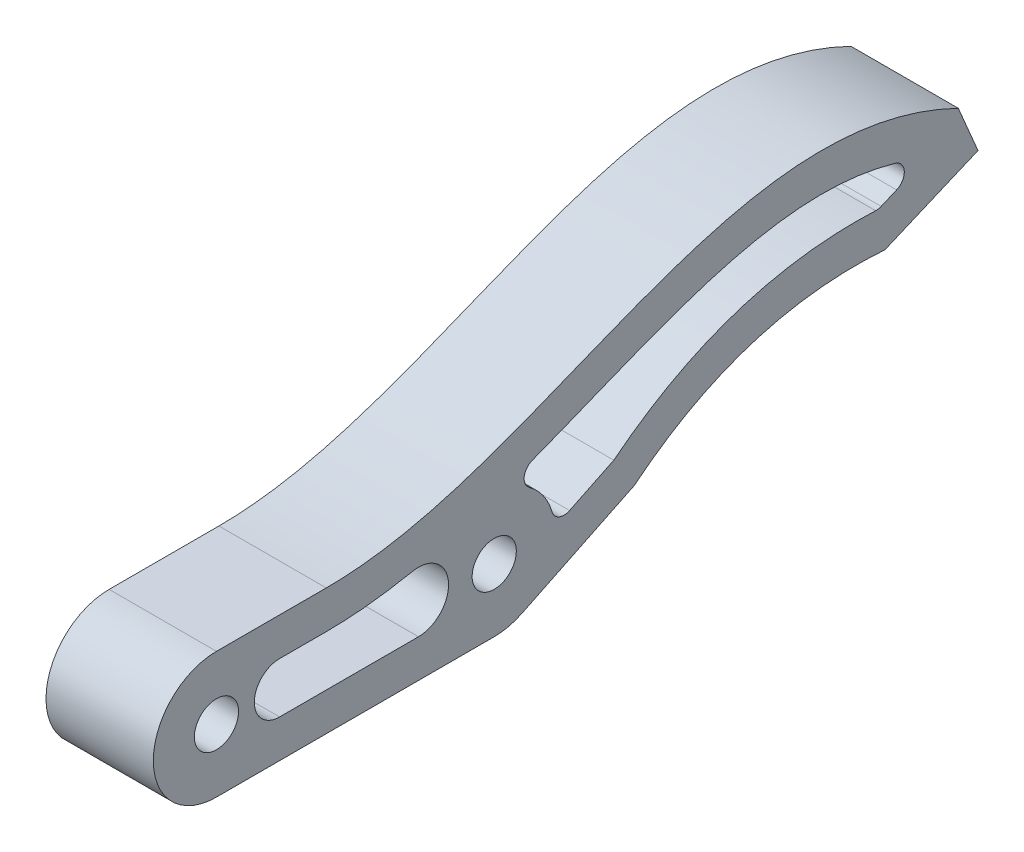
ISO-10303-21;
HEADER;
FILE_DESCRIPTION(('STEP AP214'),'2;1');
FILE_NAME('part.step','',(''),(''),'','','');
FILE_SCHEMA(('AUTOMOTIVE_DESIGN { 1 0 10303 214 1 1 1 1 }'));
ENDSEC;
DATA;
#1=APPLICATION_CONTEXT('core data for automotive mechanical design processes');
#2=APPLICATION_PROTOCOL_DEFINITION('international standard','automotive_design',2000,#1);
#3=PRODUCT_CONTEXT('',#1,'mechanical');
#4=PRODUCT('Part','Part','',(#3));
#5=PRODUCT_RELATED_PRODUCT_CATEGORY('part','',(#4));
#6=PRODUCT_DEFINITION_FORMATION('','',#4);
#7=PRODUCT_DEFINITION_CONTEXT('part definition',#1,'design');
#8=PRODUCT_DEFINITION('design','',#6,#7);
#9=PRODUCT_DEFINITION_SHAPE('','',#8);
#10=(LENGTH_UNIT() NAMED_UNIT(*) SI_UNIT(.MILLI.,.METRE.));
#11=(NAMED_UNIT(*) PLANE_ANGLE_UNIT() SI_UNIT($,.RADIAN.));
#12=(NAMED_UNIT(*) SI_UNIT($,.STERADIAN.) SOLID_ANGLE_UNIT());
#13=UNCERTAINTY_MEASURE_WITH_UNIT(LENGTH_MEASURE(1.E-05),#10,'distance_accuracy_value','');
#14=(GEOMETRIC_REPRESENTATION_CONTEXT(3) GLOBAL_UNCERTAINTY_ASSIGNED_CONTEXT((#13)) GLOBAL_UNIT_ASSIGNED_CONTEXT((#10,
#11,#12)) REPRESENTATION_CONTEXT('',''));
#15=CARTESIAN_POINT('',(0.,0.,0.));
#16=DIRECTION('',(0.,0.,1.));
#17=DIRECTION('',(1.,0.,0.));
#18=AXIS2_PLACEMENT_3D('',#15,#16,#17);
#19=CARTESIAN_POINT('',(8.5,5.,-27.));
#20=DIRECTION('',(-1.,0.,0.));
#21=DIRECTION('',(0.,0.,1.));
#22=AXIS2_PLACEMENT_3D('',#19,#20,#21);
#23=CYLINDRICAL_SURFACE('',#22,5.);
#24=DIRECTION('',(1.,0.,0.));
#25=VECTOR('',#24,1.);
#26=CARTESIAN_POINT('',(0.,0.502127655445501,-29.1838370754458));
#27=LINE('',#26,#25);
#28=CARTESIAN_POINT('',(0.,0.502127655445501,-29.1838370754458));
#29=VERTEX_POINT('',#28);
#30=CARTESIAN_POINT('',(8.5,0.502127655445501,-29.1838370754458));
#31=VERTEX_POINT('',#30);
#32=EDGE_CURVE('E597',#29,#31,#27,.T.);
#33=ORIENTED_EDGE('',*,*,#32,.T.);
#34=CARTESIAN_POINT('',(8.5,5.,-27.));
#35=DIRECTION('',(1.,0.,0.));
#36=DIRECTION('',(0.,0.,-1.));
#37=AXIS2_PLACEMENT_3D('',#34,#35,#36);
#38=CIRCLE('',#37,5.);
#39=CARTESIAN_POINT('',(8.5,0.,-27.));
#40=VERTEX_POINT('',#39);
#41=EDGE_CURVE('E583',#40,#31,#38,.T.);
#42=ORIENTED_EDGE('',*,*,#41,.F.);
#43=DIRECTION('',(-1.,0.,0.));
#44=VECTOR('',#43,1.);
#45=CARTESIAN_POINT('',(8.5,0.,-27.));
#46=LINE('',#45,#44);
#47=CARTESIAN_POINT('',(0.,0.,-27.));
#48=VERTEX_POINT('',#47);
#49=EDGE_CURVE('E554',#40,#48,#46,.T.);
#50=ORIENTED_EDGE('',*,*,#49,.T.);
#51=CARTESIAN_POINT('',(0.,5.,-27.));
#52=DIRECTION('',(1.,0.,0.));
#53=DIRECTION('',(0.,0.,-1.));
#54=AXIS2_PLACEMENT_3D('',#51,#52,#53);
#55=CIRCLE('',#54,5.);
#56=EDGE_CURVE('E567',#48,#29,#55,.T.);
#57=ORIENTED_EDGE('',*,*,#56,.T.);
#58=EDGE_LOOP('',(#33,#42,#50,#57));
#59=FACE_BOUND('',#58,.T.);
#60=ADVANCED_FACE('F45',(#59),#23,.T.);
#61=CARTESIAN_POINT('',(8.5,10.,0.));
#62=DIRECTION('',(0.,1.,0.));
#63=DIRECTION('',(0.,0.,1.));
#64=AXIS2_PLACEMENT_3D('',#61,#62,#63);
#65=PLANE('',#64);
#66=DIRECTION('',(1.,0.,0.));
#67=VECTOR('',#66,1.);
#68=CARTESIAN_POINT('',(0.,10.,-13.6949747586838));
#69=LINE('',#68,#67);
#70=CARTESIAN_POINT('',(0.,10.,-13.6949747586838));
#71=VERTEX_POINT('',#70);
#72=CARTESIAN_POINT('',(8.5,10.,-13.6949747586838));
#73=VERTEX_POINT('',#72);
#74=EDGE_CURVE('E594',#71,#73,#69,.T.);
#75=ORIENTED_EDGE('',*,*,#74,.F.);
#76=DIRECTION('',(0.,0.,-1.));
#77=VECTOR('',#76,1.);
#78=CARTESIAN_POINT('',(0.,10.,0.));
#79=LINE('',#78,#77);
#80=CARTESIAN_POINT('',(0.,10.,-5.));
#81=VERTEX_POINT('',#80);
#82=EDGE_CURVE('E574',#81,#71,#79,.T.);
#83=ORIENTED_EDGE('',*,*,#82,.F.);
#84=DIRECTION('',(-1.,0.,0.));
#85=VECTOR('',#84,1.);
#86=CARTESIAN_POINT('',(8.5,10.,-5.));
#87=LINE('',#86,#85);
#88=CARTESIAN_POINT('',(8.5,10.,-5.));
#89=VERTEX_POINT('',#88);
#90=EDGE_CURVE('E547',#89,#81,#87,.T.);
#91=ORIENTED_EDGE('',*,*,#90,.F.);
#92=DIRECTION('',(0.,0.,-1.));
#93=VECTOR('',#92,1.);
#94=CARTESIAN_POINT('',(8.5,10.,0.));
#95=LINE('',#94,#93);
#96=EDGE_CURVE('E563',#89,#73,#95,.T.);
#97=ORIENTED_EDGE('',*,*,#96,.T.);
#98=EDGE_LOOP('',(#75,#83,#91,#97));
#99=FACE_BOUND('',#98,.T.);
#100=ADVANCED_FACE('F645',(#99),#65,.T.);
#101=CARTESIAN_POINT('',(8.5,5.,-5.));
#102=DIRECTION('',(-1.,0.,0.));
#103=DIRECTION('',(0.,0.,1.));
#104=AXIS2_PLACEMENT_3D('',#101,#102,#103);
#105=CYLINDRICAL_SURFACE('',#104,5.);
#106=CARTESIAN_POINT('',(0.,5.,-5.));
#107=DIRECTION('',(1.,0.,0.));
#108=DIRECTION('',(0.,0.,-1.));
#109=AXIS2_PLACEMENT_3D('',#106,#107,#108);
#110=CIRCLE('',#109,5.);
#111=CARTESIAN_POINT('',(0.,0.,-5.));
#112=VERTEX_POINT('',#111);
#113=EDGE_CURVE('E572',#81,#112,#110,.T.);
#114=ORIENTED_EDGE('',*,*,#113,.T.);
#115=DIRECTION('',(-1.,0.,0.));
#116=VECTOR('',#115,1.);
#117=CARTESIAN_POINT('',(8.5,0.,-5.));
#118=LINE('',#117,#116);
#119=CARTESIAN_POINT('',(8.5,0.,-5.));
#120=VERTEX_POINT('',#119);
#121=EDGE_CURVE('E549',#120,#112,#118,.T.);
#122=ORIENTED_EDGE('',*,*,#121,.F.);
#123=CARTESIAN_POINT('',(8.5,5.,-5.));
#124=DIRECTION('',(1.,0.,0.));
#125=DIRECTION('',(0.,0.,-1.));
#126=AXIS2_PLACEMENT_3D('',#123,#124,#125);
#127=CIRCLE('',#126,5.);
#128=EDGE_CURVE('E588',#89,#120,#127,.T.);
#129=ORIENTED_EDGE('',*,*,#128,.F.);
#130=ORIENTED_EDGE('',*,*,#90,.T.);
#131=EDGE_LOOP('',(#114,#122,#129,#130));
#132=FACE_BOUND('',#131,.T.);
#133=ADVANCED_FACE('F651',(#132),#105,.T.);
#134=CARTESIAN_POINT('',(8.5,0.,0.));
#135=DIRECTION('',(0.,1.,0.));
#136=DIRECTION('',(0.,0.,1.));
#137=AXIS2_PLACEMENT_3D('',#134,#135,#136);
#138=PLANE('',#137);
#139=DIRECTION('',(0.,0.,-1.));
#140=VECTOR('',#139,1.);
#141=CARTESIAN_POINT('',(0.,0.,0.));
#142=LINE('',#141,#140);
#143=EDGE_CURVE('E570',#112,#48,#142,.T.);
#144=ORIENTED_EDGE('',*,*,#143,.T.);
#145=ORIENTED_EDGE('',*,*,#49,.F.);
#146=DIRECTION('',(0.,0.,-1.));
#147=VECTOR('',#146,1.);
#148=CARTESIAN_POINT('',(8.5,0.,0.));
#149=LINE('',#148,#147);
#150=EDGE_CURVE('E586',#120,#40,#149,.T.);
#151=ORIENTED_EDGE('',*,*,#150,.F.);
#152=ORIENTED_EDGE('',*,*,#121,.T.);
#153=EDGE_LOOP('',(#144,#145,#151,#152));
#154=FACE_BOUND('',#153,.T.);
#155=ADVANCED_FACE('F657',(#154),#138,.F.);
#156=CARTESIAN_POINT('',(8.5,5.,-5.));
#157=DIRECTION('',(-1.,0.,0.));
#158=DIRECTION('',(0.,0.,1.));
#159=AXIS2_PLACEMENT_3D('',#156,#157,#158);
#160=CYLINDRICAL_SURFACE('',#159,1.75);
#161=CARTESIAN_POINT('',(8.5,5.,-5.));
#162=DIRECTION('',(1.,0.,0.));
#163=DIRECTION('',(0.,0.,-1.));
#164=AXIS2_PLACEMENT_3D('',#161,#162,#163);
#165=CIRCLE('',#164,1.75);
#166=CARTESIAN_POINT('',(8.5,5.,-6.75));
#167=VERTEX_POINT('',#166);
#168=EDGE_CURVE('E580',#167,#167,#165,.T.);
#169=ORIENTED_EDGE('',*,*,#168,.T.);
#170=EDGE_LOOP('',(#169));
#171=FACE_BOUND('',#170,.T.);
#172=CARTESIAN_POINT('',(0.,5.,-5.));
#173=DIRECTION('',(1.,0.,0.));
#174=DIRECTION('',(0.,0.,-1.));
#175=AXIS2_PLACEMENT_3D('',#172,#173,#174);
#176=CIRCLE('',#175,1.75);
#177=CARTESIAN_POINT('',(0.,5.,-6.75));
#178=VERTEX_POINT('',#177);
#179=EDGE_CURVE('E564',#178,#178,#176,.T.);
#180=ORIENTED_EDGE('',*,*,#179,.F.);
#181=EDGE_LOOP('',(#180));
#182=FACE_BOUND('',#181,.T.);
#183=ADVANCED_FACE('F656',(#171,#182),#160,.F.);
#184=CARTESIAN_POINT('',(8.5,5.,-27.));
#185=DIRECTION('',(-1.,0.,0.));
#186=DIRECTION('',(0.,0.,1.));
#187=AXIS2_PLACEMENT_3D('',#184,#185,#186);
#188=CYLINDRICAL_SURFACE('',#187,1.75);
#189=CARTESIAN_POINT('',(8.5,5.,-27.));
#190=DIRECTION('',(1.,0.,0.));
#191=DIRECTION('',(0.,0.,-1.));
#192=AXIS2_PLACEMENT_3D('',#189,#190,#191);
#193=CIRCLE('',#192,1.75);
#194=CARTESIAN_POINT('',(8.5,5.,-28.75));
#195=VERTEX_POINT('',#194);
#196=EDGE_CURVE('E559',#195,#195,#193,.T.);
#197=ORIENTED_EDGE('',*,*,#196,.T.);
#198=EDGE_LOOP('',(#197));
#199=FACE_BOUND('',#198,.T.);
#200=CARTESIAN_POINT('',(0.,5.,-27.));
#201=DIRECTION('',(1.,0.,0.));
#202=DIRECTION('',(0.,0.,-1.));
#203=AXIS2_PLACEMENT_3D('',#200,#201,#202);
#204=CIRCLE('',#203,1.75);
#205=CARTESIAN_POINT('',(0.,5.,-28.75));
#206=VERTEX_POINT('',#205);
#207=EDGE_CURVE('E560',#206,#206,#204,.T.);
#208=ORIENTED_EDGE('',*,*,#207,.F.);
#209=EDGE_LOOP('',(#208));
#210=FACE_BOUND('',#209,.T.);
#211=ADVANCED_FACE('F366',(#199,#210),#188,.F.);
#212=CARTESIAN_POINT('',(8.5,0.,0.));
#213=DIRECTION('',(1.,0.,0.));
#214=DIRECTION('',(0.,0.,-1.));
#215=AXIS2_PLACEMENT_3D('',#212,#213,#214);
#216=PLANE('',#215);
#217=CARTESIAN_POINT('',(8.5,5.,-10.));
#218=DIRECTION('',(-1.,0.,0.));
#219=DIRECTION('',(0.,0.,1.));
#220=AXIS2_PLACEMENT_3D('',#217,#218,#219);
#221=CIRCLE('',#220,2.);
#222=CARTESIAN_POINT('',(8.5,3.,-10.));
#223=VERTEX_POINT('',#222);
#224=CARTESIAN_POINT('',(8.5,7.,-10.));
#225=VERTEX_POINT('',#224);
#226=EDGE_CURVE('E205',#223,#225,#221,.T.);
#227=ORIENTED_EDGE('',*,*,#226,.T.);
#228=DIRECTION('',(0.,0.,-1.));
#229=VECTOR('',#228,1.);
#230=CARTESIAN_POINT('',(8.5,7.,-13.6949747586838));
#231=LINE('',#230,#229);
#232=CARTESIAN_POINT('',(8.5,7.,-13.6949747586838));
#233=VERTEX_POINT('',#232);
#234=EDGE_CURVE('E217',#225,#233,#231,.T.);
#235=ORIENTED_EDGE('',*,*,#234,.T.);
#236=CARTESIAN_POINT('',(8.5,7.71980303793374,-20.5267376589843));
#237=CARTESIAN_POINT('',(8.5,7.27218222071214,-18.3171382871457));
#238=CARTESIAN_POINT('',(8.5,7.,-16.0394109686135));
#239=CARTESIAN_POINT('',(8.5,7.,-13.6949747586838));
#240=B_SPLINE_CURVE_WITH_KNOTS('',3,(#236,#237,#238,#239),.UNSPECIFIED.,.F.,.F.,(4,4),(0.,
0.121649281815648),.UNSPECIFIED.);
#241=CARTESIAN_POINT('',(8.5,7.71980303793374,-20.5267376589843));
#242=VERTEX_POINT('',#241);
#243=EDGE_CURVE('E221',#233,#242,#240,.F.);
#244=ORIENTED_EDGE('',*,*,#243,.T.);
#245=CARTESIAN_POINT('',(8.5,5.38362891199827,-21.));
#246=DIRECTION('',(-1.,0.,0.));
#247=DIRECTION('',(0.,0.,1.));
#248=AXIS2_PLACEMENT_3D('',#245,#246,#247);
#249=CIRCLE('',#248,2.38362891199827);
#250=CARTESIAN_POINT('',(8.5,3.,-21.));
#251=VERTEX_POINT('',#250);
#252=EDGE_CURVE('E480',#242,#251,#249,.T.);
#253=ORIENTED_EDGE('',*,*,#252,.T.);
#254=DIRECTION('',(0.,0.,1.));
#255=VECTOR('',#254,1.);
#256=CARTESIAN_POINT('',(8.5,3.,-10.));
#257=LINE('',#256,#255);
#258=EDGE_CURVE('E213',#251,#223,#257,.T.);
#259=ORIENTED_EDGE('',*,*,#258,.T.);
#260=EDGE_LOOP('',(#227,#235,#244,#253,#259));
#261=FACE_BOUND('',#260,.T.);
#262=CARTESIAN_POINT('',(8.5,5.,-27.));
#263=DIRECTION('',(1.,0.,0.));
#264=DIRECTION('',(0.,0.,1.));
#265=AXIS2_PLACEMENT_3D('',#262,#263,#264);
#266=CIRCLE('',#265,4.75);
#267=CARTESIAN_POINT('',(8.5,6.29990299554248,-31.568670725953));
#268=VERTEX_POINT('',#267);
#269=CARTESIAN_POINT('',(8.5,8.85013348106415,-29.7819008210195));
#270=VERTEX_POINT('',#269);
#271=EDGE_CURVE('E294',#268,#270,#266,.T.);
#272=ORIENTED_EDGE('',*,*,#271,.T.);
#273=CARTESIAN_POINT('',(8.5,9.66068789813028,-30.3675641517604));
#274=DIRECTION('',(1.,0.,0.));
#275=DIRECTION('',(0.,0.,-1.));
#276=AXIS2_PLACEMENT_3D('',#273,#274,#275);
#277=CIRCLE('',#276,1.);
#278=CARTESIAN_POINT('',(8.5,10.5960936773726,-30.012977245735));
#279=VERTEX_POINT('',#278);
#280=EDGE_CURVE('E510',#270,#279,#277,.F.);
#281=ORIENTED_EDGE('',*,*,#280,.T.);
#282=CARTESIAN_POINT('',(8.5,16.5979910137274,-58.7502320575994));
#283=CARTESIAN_POINT('',(8.5,16.796520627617,-58.0528071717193));
#284=CARTESIAN_POINT('',(8.5,16.9539827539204,-57.3619943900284));
#285=CARTESIAN_POINT('',(8.5,17.4059040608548,-54.801858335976));
#286=CARTESIAN_POINT('',(8.5,17.4661629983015,-52.9551397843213));
#287=CARTESIAN_POINT('',(8.5,17.1706448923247,-49.2263439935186));
#288=CARTESIAN_POINT('',(8.5,16.8124814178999,-47.3449992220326));
#289=CARTESIAN_POINT('',(8.5,15.7923179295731,-43.5217260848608));
#290=CARTESIAN_POINT('',(8.5,15.1303137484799,-41.5812954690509));
#291=CARTESIAN_POINT('',(8.5,13.6451743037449,-37.6352435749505));
#292=CARTESIAN_POINT('',(8.5,12.8223926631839,-35.6300299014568));
#293=CARTESIAN_POINT('',(8.5,11.5261343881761,-32.4083186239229));
#294=CARTESIAN_POINT('',(8.5,11.05278823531,-31.2187538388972));
#295=CARTESIAN_POINT('',(8.5,10.5957590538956,-30.0131040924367));
#296=B_SPLINE_CURVE_WITH_KNOTS('',3,(#282,#283,#284,#285,#286,#287,#288,#289,#290,#291,#292,
#293,#294,#295),.UNSPECIFIED.,.F.,.F.,(4,2,2,2,2,2,4),(0.303121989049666,0.348941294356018,
0.473941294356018,0.598941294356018,0.723941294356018,0.848941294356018,0.920819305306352),.UNSPECIFIED.);
#297=CARTESIAN_POINT('',(8.5,16.5978363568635,-58.7501880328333));
#298=VERTEX_POINT('',#297);
#299=EDGE_CURVE('E289',#279,#298,#296,.F.);
#300=ORIENTED_EDGE('',*,*,#299,.T.);
#301=CARTESIAN_POINT('',(8.5,15.6361998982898,-58.476447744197));
#302=DIRECTION('',(1.,0.,0.));
#303=DIRECTION('',(0.,0.,-1.));
#304=AXIS2_PLACEMENT_3D('',#301,#302,#303);
#305=CIRCLE('',#304,1.);
#306=CARTESIAN_POINT('',(8.5,14.7154737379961,-58.8666570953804));
#307=VERTEX_POINT('',#306);
#308=EDGE_CURVE('E11',#298,#307,#305,.F.);
#309=ORIENTED_EDGE('',*,*,#308,.T.);
#310=DIRECTION('',(0.,-0.39020935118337,0.920726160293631));
#311=VECTOR('',#310,1.);
#312=CARTESIAN_POINT('',(8.5,14.1066831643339,-57.4301733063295));
#313=LINE('',#312,#311);
#314=CARTESIAN_POINT('',(8.5,14.1960940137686,-57.6411444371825));
#315=VERTEX_POINT('',#314);
#316=EDGE_CURVE('E499',#307,#315,#313,.T.);
#317=ORIENTED_EDGE('',*,*,#316,.T.);
#318=CARTESIAN_POINT('',(8.5,15.1168201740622,-57.2509350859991));
#319=DIRECTION('',(1.,0.,0.));
#320=DIRECTION('',(0.,0.,-1.));
#321=AXIS2_PLACEMENT_3D('',#318,#319,#320);
#322=CIRCLE('',#321,1.);
#323=CARTESIAN_POINT('',(8.5,14.1178972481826,-57.2045618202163));
#324=VERTEX_POINT('',#323);
#325=EDGE_CURVE('E518',#315,#324,#322,.F.);
#326=ORIENTED_EDGE('',*,*,#325,.T.);
#327=CARTESIAN_POINT('',(8.5,7.37494733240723,-36.4705828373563));
#328=CARTESIAN_POINT('',(8.5,8.6233127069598,-38.0402338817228));
#329=CARTESIAN_POINT('',(8.5,9.70763847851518,-39.6774903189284));
#330=CARTESIAN_POINT('',(8.5,11.5318379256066,-43.0806957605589));
#331=CARTESIAN_POINT('',(8.5,12.271381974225,-44.8465467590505));
#332=CARTESIAN_POINT('',(8.5,13.393385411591,-48.4888330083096));
#333=CARTESIAN_POINT('',(8.5,13.7757268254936,-50.3648820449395));
#334=CARTESIAN_POINT('',(8.5,14.15011014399,-53.8954716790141));
#335=CARTESIAN_POINT('',(8.5,14.1953220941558,-55.5367321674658));
#336=CARTESIAN_POINT('',(8.5,14.1178959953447,-57.2045617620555));
#337=B_SPLINE_CURVE_WITH_KNOTS('',3,(#327,#328,#329,#330,#331,#332,#333,#334,#335,#336),
.UNSPECIFIED.,.F.,.F.,(4,2,2,2,4),(0.0403332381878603,0.29033323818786,0.54033323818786,
0.79033323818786,1.),.UNSPECIFIED.);
#338=CARTESIAN_POINT('',(8.5,7.37494733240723,-36.4705828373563));
#339=VERTEX_POINT('',#338);
#340=EDGE_CURVE('E391',#324,#339,#337,.F.);
#341=ORIENTED_EDGE('',*,*,#340,.T.);
#342=DIRECTION('',(0.,-0.436767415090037,0.899574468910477));
#343=VECTOR('',#342,1.);
#344=CARTESIAN_POINT('',(8.5,5.08262939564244,-31.7492812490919));
#345=LINE('',#344,#343);
#346=CARTESIAN_POINT('',(8.5,5.67399231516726,-32.9672635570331));
#347=VERTEX_POINT('',#346);
#348=EDGE_CURVE('E297',#339,#347,#345,.T.);
#349=ORIENTED_EDGE('',*,*,#348,.T.);
#350=CARTESIAN_POINT('',(8.5,6.57356678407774,-32.5304961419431));
#351=DIRECTION('',(1.,0.,0.));
#352=DIRECTION('',(0.,0.,-1.));
#353=AXIS2_PLACEMENT_3D('',#350,#351,#352);
#354=CIRCLE('',#353,1.);
#355=EDGE_CURVE('E506',#347,#268,#354,.F.);
#356=ORIENTED_EDGE('',*,*,#355,.T.);
#357=EDGE_LOOP('',(#272,#281,#300,#309,#317,#326,#341,#349,#356));
#358=FACE_BOUND('',#357,.T.);
#359=ORIENTED_EDGE('',*,*,#96,.F.);
#360=ORIENTED_EDGE('',*,*,#128,.T.);
#361=ORIENTED_EDGE('',*,*,#150,.T.);
#362=ORIENTED_EDGE('',*,*,#41,.T.);
#363=DIRECTION('',(0.,0.436767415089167,-0.8995744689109));
#364=VECTOR('',#363,1.);
#365=CARTESIAN_POINT('',(8.5,-11.0601312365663,-5.36998891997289));
#366=LINE('',#365,#364);
#367=CARTESIAN_POINT('',(8.5,4.82408407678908,-38.0854206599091));
#368=VERTEX_POINT('',#367);
#369=EDGE_CURVE('E612',#31,#368,#366,.T.);
#370=ORIENTED_EDGE('',*,*,#369,.T.);
#371=CARTESIAN_POINT('',(8.5,4.82408407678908,-38.0854206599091));
#372=CARTESIAN_POINT('',(8.5,11.8952224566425,-46.7975095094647));
#373=CARTESIAN_POINT('',(8.5,11.0678436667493,-57.9480004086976));
#374=B_SPLINE_CURVE_WITH_KNOTS('',2,(#371,#372,#373),.UNSPECIFIED.,.F.,.F.,(3,3),(0.,1.),.UNSPECIFIED.);
#375=CARTESIAN_POINT('',(8.5,11.0678436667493,-57.9480004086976));
#376=VERTEX_POINT('',#375);
#377=EDGE_CURVE('E607',#368,#376,#374,.T.);
#378=ORIENTED_EDGE('',*,*,#377,.T.);
#379=DIRECTION('',(0.,0.39020935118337,-0.920726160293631));
#380=VECTOR('',#379,1.);
#381=CARTESIAN_POINT('',(8.5,-11.4367064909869,-4.84694582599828));
#382=LINE('',#381,#380);
#383=CARTESIAN_POINT('',(8.5,14.1895184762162,-65.3138096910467));
#384=VERTEX_POINT('',#383);
#385=EDGE_CURVE('E341',#376,#384,#382,.T.);
#386=ORIENTED_EDGE('',*,*,#385,.T.);
#387=DIRECTION('',(0.,0.920726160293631,0.39020935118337));
#388=VECTOR('',#387,1.);
#389=CARTESIAN_POINT('',(8.5,25.6262249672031,-60.4668638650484));
#390=LINE('',#389,#388);
#391=CARTESIAN_POINT('',(8.5,17.8724231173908,-63.7529722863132));
#392=VERTEX_POINT('',#391);
#393=EDGE_CURVE('E487',#384,#392,#390,.T.);
#394=ORIENTED_EDGE('',*,*,#393,.T.);
#395=CARTESIAN_POINT('',(8.5,17.8724231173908,-63.7529722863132));
#396=CARTESIAN_POINT('',(8.5,26.563787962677,-45.9288826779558));
#397=CARTESIAN_POINT('',(8.5,10.,-31.059268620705));
#398=CARTESIAN_POINT('',(8.5,10.,-13.6949747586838));
#399=B_SPLINE_CURVE_WITH_KNOTS('',3,(#395,#396,#397,#398),.UNSPECIFIED.,.F.,.F.,(4,4),(0.,1.),.UNSPECIFIED.);
#400=EDGE_CURVE('E490',#392,#73,#399,.T.);
#401=ORIENTED_EDGE('',*,*,#400,.T.);
#402=EDGE_LOOP('',(#359,#360,#361,#362,#370,#378,#386,#394,#401));
#403=FACE_BOUND('',#402,.T.);
#404=ORIENTED_EDGE('',*,*,#168,.F.);
#405=EDGE_LOOP('',(#404));
#406=FACE_BOUND('',#405,.T.);
#407=ORIENTED_EDGE('',*,*,#196,.F.);
#408=EDGE_LOOP('',(#407));
#409=FACE_BOUND('',#408,.T.);
#410=ADVANCED_FACE('F223',(#261,#358,#403,#406,#409),#216,.T.);
#411=CARTESIAN_POINT('',(0.,0.,0.));
#412=DIRECTION('',(1.,0.,0.));
#413=DIRECTION('',(0.,0.,-1.));
#414=AXIS2_PLACEMENT_3D('',#411,#412,#413);
#415=PLANE('',#414);
#416=DIRECTION('',(0.,0.,-1.));
#417=VECTOR('',#416,1.);
#418=CARTESIAN_POINT('',(0.,7.,-13.6949747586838));
#419=LINE('',#418,#417);
#420=CARTESIAN_POINT('',(0.,7.,-10.));
#421=VERTEX_POINT('',#420);
#422=CARTESIAN_POINT('',(0.,7.,-13.6949747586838));
#423=VERTEX_POINT('',#422);
#424=EDGE_CURVE('E263',#421,#423,#419,.T.);
#425=ORIENTED_EDGE('',*,*,#424,.F.);
#426=CARTESIAN_POINT('',(0.,5.,-10.));
#427=DIRECTION('',(-1.,0.,0.));
#428=DIRECTION('',(0.,0.,1.));
#429=AXIS2_PLACEMENT_3D('',#426,#427,#428);
#430=CIRCLE('',#429,2.);
#431=CARTESIAN_POINT('',(0.,3.,-10.));
#432=VERTEX_POINT('',#431);
#433=EDGE_CURVE('E208',#432,#421,#430,.T.);
#434=ORIENTED_EDGE('',*,*,#433,.F.);
#435=DIRECTION('',(0.,0.,1.));
#436=VECTOR('',#435,1.);
#437=CARTESIAN_POINT('',(0.,3.,-10.));
#438=LINE('',#437,#436);
#439=CARTESIAN_POINT('',(0.,3.,-21.));
#440=VERTEX_POINT('',#439);
#441=EDGE_CURVE('E226',#440,#432,#438,.T.);
#442=ORIENTED_EDGE('',*,*,#441,.F.);
#443=CARTESIAN_POINT('',(0.,5.38362891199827,-21.));
#444=DIRECTION('',(-1.,0.,0.));
#445=DIRECTION('',(0.,0.,1.));
#446=AXIS2_PLACEMENT_3D('',#443,#444,#445);
#447=CIRCLE('',#446,2.38362891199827);
#448=CARTESIAN_POINT('',(0.,7.71980303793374,-20.5267376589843));
#449=VERTEX_POINT('',#448);
#450=EDGE_CURVE('E229',#449,#440,#447,.T.);
#451=ORIENTED_EDGE('',*,*,#450,.F.);
#452=CARTESIAN_POINT('',(0.,7.,-13.6949747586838));
#453=CARTESIAN_POINT('',(0.,7.,-16.0394109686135));
#454=CARTESIAN_POINT('',(0.,7.27218222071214,-18.3171382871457));
#455=CARTESIAN_POINT('',(0.,7.71980303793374,-20.5267376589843));
#456=B_SPLINE_CURVE_WITH_KNOTS('',3,(#452,#453,#454,#455),.UNSPECIFIED.,.F.,.F.,(4,4),(0.,
0.121649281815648),.UNSPECIFIED.);
#457=EDGE_CURVE('E270',#423,#449,#456,.T.);
#458=ORIENTED_EDGE('',*,*,#457,.F.);
#459=EDGE_LOOP('',(#425,#434,#442,#451,#458));
#460=FACE_BOUND('',#459,.T.);
#461=DIRECTION('',(0.,-0.39020935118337,0.920726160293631));
#462=VECTOR('',#461,1.);
#463=CARTESIAN_POINT('',(0.,14.1066831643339,-57.4301733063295));
#464=LINE('',#463,#462);
#465=CARTESIAN_POINT('',(0.,14.7154737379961,-58.8666570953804));
#466=VERTEX_POINT('',#465);
#467=CARTESIAN_POINT('',(0.,14.1960940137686,-57.6411444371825));
#468=VERTEX_POINT('',#467);
#469=EDGE_CURVE('E492',#466,#468,#464,.T.);
#470=ORIENTED_EDGE('',*,*,#469,.F.);
#471=CARTESIAN_POINT('',(0.,15.6361998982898,-58.476447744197));
#472=DIRECTION('',(1.,0.,0.));
#473=DIRECTION('',(0.,0.,-1.));
#474=AXIS2_PLACEMENT_3D('',#471,#472,#473);
#475=CIRCLE('',#474,1.);
#476=CARTESIAN_POINT('',(0.,16.5978363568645,-58.7501880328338));
#477=VERTEX_POINT('',#476);
#478=EDGE_CURVE('E54',#466,#477,#475,.T.);
#479=ORIENTED_EDGE('',*,*,#478,.T.);
#480=CARTESIAN_POINT('',(0.,10.5957590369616,-30.0131040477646));
#481=CARTESIAN_POINT('',(0.,11.0527882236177,-31.2187538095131));
#482=CARTESIAN_POINT('',(0.,11.5261343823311,-32.4083186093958));
#483=CARTESIAN_POINT('',(0.,12.8223926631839,-35.6300299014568));
#484=CARTESIAN_POINT('',(0.,13.6451743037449,-37.6352435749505));
#485=CARTESIAN_POINT('',(0.,15.1303137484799,-41.5812954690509));
#486=CARTESIAN_POINT('',(0.,15.7923179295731,-43.5217260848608));
#487=CARTESIAN_POINT('',(0.,16.8124814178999,-47.3449992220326));
#488=CARTESIAN_POINT('',(0.,17.1706448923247,-49.2263439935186));
#489=CARTESIAN_POINT('',(0.,17.4661629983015,-52.9551397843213));
#490=CARTESIAN_POINT('',(0.,17.4059040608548,-54.801858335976));
#491=CARTESIAN_POINT('',(0.,16.9539827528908,-57.3619943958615));
#492=CARTESIAN_POINT('',(0.,16.7965206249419,-58.0528071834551));
#493=CARTESIAN_POINT('',(0.,16.5979910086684,-58.7502320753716));
#494=B_SPLINE_CURVE_WITH_KNOTS('',3,(#480,#481,#482,#483,#484,#485,#486,#487,#488,#489,#490,
#491,#492,#493),.UNSPECIFIED.,.F.,.F.,(4,2,2,2,2,2,4),(0.303121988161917,0.375,0.5,0.625,0.75,
0.875,0.920819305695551),.UNSPECIFIED.);
#495=CARTESIAN_POINT('',(0.,10.5960936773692,-30.012977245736));
#496=VERTEX_POINT('',#495);
#497=EDGE_CURVE('E453',#496,#477,#494,.T.);
#498=ORIENTED_EDGE('',*,*,#497,.F.);
#499=CARTESIAN_POINT('',(0.,9.66068789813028,-30.3675641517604));
#500=DIRECTION('',(1.,0.,0.));
#501=DIRECTION('',(0.,0.,-1.));
#502=AXIS2_PLACEMENT_3D('',#499,#500,#501);
#503=CIRCLE('',#502,1.);
#504=CARTESIAN_POINT('',(0.,8.85013348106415,-29.7819008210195));
#505=VERTEX_POINT('',#504);
#506=EDGE_CURVE('E508',#496,#505,#503,.T.);
#507=ORIENTED_EDGE('',*,*,#506,.T.);
#508=CARTESIAN_POINT('',(0.,5.,-27.));
#509=DIRECTION('',(1.,0.,0.));
#510=DIRECTION('',(0.,0.,1.));
#511=AXIS2_PLACEMENT_3D('',#508,#509,#510);
#512=CIRCLE('',#511,4.75);
#513=CARTESIAN_POINT('',(0.,6.29990299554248,-31.568670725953));
#514=VERTEX_POINT('',#513);
#515=EDGE_CURVE('E284',#514,#505,#512,.T.);
#516=ORIENTED_EDGE('',*,*,#515,.F.);
#517=CARTESIAN_POINT('',(0.,6.57356678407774,-32.5304961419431));
#518=DIRECTION('',(1.,0.,0.));
#519=DIRECTION('',(0.,0.,-1.));
#520=AXIS2_PLACEMENT_3D('',#517,#518,#519);
#521=CIRCLE('',#520,1.);
#522=CARTESIAN_POINT('',(0.,5.67399231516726,-32.9672635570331));
#523=VERTEX_POINT('',#522);
#524=EDGE_CURVE('E504',#514,#523,#521,.T.);
#525=ORIENTED_EDGE('',*,*,#524,.T.);
#526=DIRECTION('',(0.,-0.436767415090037,0.899574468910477));
#527=VECTOR('',#526,1.);
#528=CARTESIAN_POINT('',(0.,5.08262939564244,-31.7492812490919));
#529=LINE('',#528,#527);
#530=CARTESIAN_POINT('',(0.,7.37494733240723,-36.4705828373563));
#531=VERTEX_POINT('',#530);
#532=EDGE_CURVE('E288',#531,#523,#529,.T.);
#533=ORIENTED_EDGE('',*,*,#532,.F.);
#534=CARTESIAN_POINT('',(0.,14.117895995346,-57.2045617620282));
#535=CARTESIAN_POINT('',(0.,14.1953220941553,-55.5367321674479));
#536=CARTESIAN_POINT('',(0.,14.1501101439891,-53.8954716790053));
#537=CARTESIAN_POINT('',(0.,13.7757268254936,-50.3648820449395));
#538=CARTESIAN_POINT('',(0.,13.393385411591,-48.4888330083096));
#539=CARTESIAN_POINT('',(0.,12.271381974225,-44.8465467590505));
#540=CARTESIAN_POINT('',(0.,11.5318379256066,-43.0806957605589));
#541=CARTESIAN_POINT('',(0.,9.70763847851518,-39.6774903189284));
#542=CARTESIAN_POINT('',(0.,8.6233127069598,-38.0402338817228));
#543=CARTESIAN_POINT('',(0.,7.37494733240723,-36.4705828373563));
#544=B_SPLINE_CURVE_WITH_KNOTS('',3,(#534,#535,#536,#537,#538,#539,#540,#541,#542,#543),
.UNSPECIFIED.,.F.,.F.,(4,2,2,2,4),(0.0403332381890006,0.25,0.5,0.75,1.),.UNSPECIFIED.);
#545=CARTESIAN_POINT('',(0.,14.1178972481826,-57.2045618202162));
#546=VERTEX_POINT('',#545);
#547=EDGE_CURVE('E433',#546,#531,#544,.T.);
#548=ORIENTED_EDGE('',*,*,#547,.F.);
#549=CARTESIAN_POINT('',(0.,15.1168201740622,-57.2509350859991));
#550=DIRECTION('',(1.,0.,0.));
#551=DIRECTION('',(0.,0.,-1.));
#552=AXIS2_PLACEMENT_3D('',#549,#550,#551);
#553=CIRCLE('',#552,1.);
#554=EDGE_CURVE('E514',#546,#468,#553,.T.);
#555=ORIENTED_EDGE('',*,*,#554,.T.);
#556=EDGE_LOOP('',(#470,#479,#498,#507,#516,#525,#533,#548,#555));
#557=FACE_BOUND('',#556,.T.);
#558=ORIENTED_EDGE('',*,*,#82,.T.);
#559=CARTESIAN_POINT('',(0.,17.8724231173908,-63.7529722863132));
#560=CARTESIAN_POINT('',(0.,26.563787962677,-45.9288826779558));
#561=CARTESIAN_POINT('',(0.,10.,-31.059268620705));
#562=CARTESIAN_POINT('',(0.,10.,-13.6949747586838));
#563=B_SPLINE_CURVE_WITH_KNOTS('',3,(#559,#560,#561,#562),.UNSPECIFIED.,.F.,.F.,(4,4),(0.,1.),.UNSPECIFIED.);
#564=CARTESIAN_POINT('',(0.,17.8724231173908,-63.7529722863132));
#565=VERTEX_POINT('',#564);
#566=EDGE_CURVE('E340',#565,#71,#563,.T.);
#567=ORIENTED_EDGE('',*,*,#566,.F.);
#568=DIRECTION('',(0.,0.920726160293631,0.39020935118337));
#569=VECTOR('',#568,1.);
#570=CARTESIAN_POINT('',(0.,25.6262249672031,-60.4668638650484));
#571=LINE('',#570,#569);
#572=CARTESIAN_POINT('',(0.,14.1895184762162,-65.3138096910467));
#573=VERTEX_POINT('',#572);
#574=EDGE_CURVE('E334',#573,#565,#571,.T.);
#575=ORIENTED_EDGE('',*,*,#574,.F.);
#576=DIRECTION('',(0.,0.39020935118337,-0.920726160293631));
#577=VECTOR('',#576,1.);
#578=CARTESIAN_POINT('',(0.,-11.4367064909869,-4.84694582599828));
#579=LINE('',#578,#577);
#580=CARTESIAN_POINT('',(0.,11.0678436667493,-57.9480004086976));
#581=VERTEX_POINT('',#580);
#582=EDGE_CURVE('E595',#581,#573,#579,.T.);
#583=ORIENTED_EDGE('',*,*,#582,.F.);
#584=CARTESIAN_POINT('',(0.,4.82408407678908,-38.0854206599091));
#585=CARTESIAN_POINT('',(0.,11.8952224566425,-46.7975095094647));
#586=CARTESIAN_POINT('',(0.,11.0678436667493,-57.9480004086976));
#587=B_SPLINE_CURVE_WITH_KNOTS('',2,(#584,#585,#586),.UNSPECIFIED.,.F.,.F.,(3,3),(0.,1.),.UNSPECIFIED.);
#588=CARTESIAN_POINT('',(0.,4.82408407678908,-38.0854206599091));
#589=VERTEX_POINT('',#588);
#590=EDGE_CURVE('E626',#589,#581,#587,.T.);
#591=ORIENTED_EDGE('',*,*,#590,.F.);
#592=DIRECTION('',(0.,0.436767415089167,-0.8995744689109));
#593=VECTOR('',#592,1.);
#594=CARTESIAN_POINT('',(0.,-11.0601312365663,-5.36998891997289));
#595=LINE('',#594,#593);
#596=EDGE_CURVE('E346',#29,#589,#595,.T.);
#597=ORIENTED_EDGE('',*,*,#596,.F.);
#598=ORIENTED_EDGE('',*,*,#56,.F.);
#599=ORIENTED_EDGE('',*,*,#143,.F.);
#600=ORIENTED_EDGE('',*,*,#113,.F.);
#601=EDGE_LOOP('',(#558,#567,#575,#583,#591,#597,#598,#599,#600));
#602=FACE_BOUND('',#601,.T.);
#603=ORIENTED_EDGE('',*,*,#179,.T.);
#604=EDGE_LOOP('',(#603));
#605=FACE_BOUND('',#604,.T.);
#606=ORIENTED_EDGE('',*,*,#207,.T.);
#607=EDGE_LOOP('',(#606));
#608=FACE_BOUND('',#607,.T.);
#609=ADVANCED_FACE('F361',(#460,#557,#602,#605,#608),#415,.F.);
#610=CARTESIAN_POINT('',(0.,25.6262249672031,-60.4668638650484));
#611=DIRECTION('',(0.,0.39020935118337,-0.920726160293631));
#612=DIRECTION('',(0.,0.920726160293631,0.39020935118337));
#613=AXIS2_PLACEMENT_3D('',#610,#611,#612);
#614=PLANE('',#613);
#615=ORIENTED_EDGE('',*,*,#393,.F.);
#616=DIRECTION('',(1.,0.,0.));
#617=VECTOR('',#616,1.);
#618=CARTESIAN_POINT('',(0.,14.1895184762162,-65.3138096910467));
#619=LINE('',#618,#617);
#620=EDGE_CURVE('E577',#573,#384,#619,.T.);
#621=ORIENTED_EDGE('',*,*,#620,.F.);
#622=ORIENTED_EDGE('',*,*,#574,.T.);
#623=DIRECTION('',(1.,0.,0.));
#624=VECTOR('',#623,1.);
#625=CARTESIAN_POINT('',(0.,17.8724231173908,-63.7529722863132));
#626=LINE('',#625,#624);
#627=EDGE_CURVE('E592',#565,#392,#626,.T.);
#628=ORIENTED_EDGE('',*,*,#627,.T.);
#629=EDGE_LOOP('',(#615,#621,#622,#628));
#630=FACE_BOUND('',#629,.T.);
#631=ADVANCED_FACE('F358',(#630),#614,.T.);
#632=CARTESIAN_POINT('',(0.,-11.4367064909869,-4.84694582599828));
#633=DIRECTION('',(0.,-0.920726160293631,-0.39020935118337));
#634=DIRECTION('',(0.,0.39020935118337,-0.920726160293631));
#635=AXIS2_PLACEMENT_3D('',#632,#633,#634);
#636=PLANE('',#635);
#637=ORIENTED_EDGE('',*,*,#385,.F.);
#638=DIRECTION('',(1.,0.,0.));
#639=VECTOR('',#638,1.);
#640=CARTESIAN_POINT('',(0.,11.0678436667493,-57.9480004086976));
#641=LINE('',#640,#639);
#642=EDGE_CURVE('E602',#581,#376,#641,.T.);
#643=ORIENTED_EDGE('',*,*,#642,.F.);
#644=ORIENTED_EDGE('',*,*,#582,.T.);
#645=ORIENTED_EDGE('',*,*,#620,.T.);
#646=EDGE_LOOP('',(#637,#643,#644,#645));
#647=FACE_BOUND('',#646,.T.);
#648=ADVANCED_FACE('F360',(#647),#636,.T.);
#649=DIRECTION('',(1.,0.,0.));
#650=VECTOR('',#649,1.);
#651=SURFACE_OF_LINEAR_EXTRUSION('',#587,#650);
#652=ORIENTED_EDGE('',*,*,#377,.F.);
#653=DIRECTION('',(1.,0.,0.));
#654=VECTOR('',#653,1.);
#655=CARTESIAN_POINT('',(0.,4.82408407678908,-38.0854206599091));
#656=LINE('',#655,#654);
#657=EDGE_CURVE('E600',#589,#368,#656,.T.);
#658=ORIENTED_EDGE('',*,*,#657,.F.);
#659=ORIENTED_EDGE('',*,*,#590,.T.);
#660=ORIENTED_EDGE('',*,*,#642,.T.);
#661=EDGE_LOOP('',(#652,#658,#659,#660));
#662=FACE_BOUND('',#661,.T.);
#663=ADVANCED_FACE('F634',(#662),#651,.T.);
#664=CARTESIAN_POINT('',(0.,-11.0601312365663,-5.36998891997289));
#665=DIRECTION('',(0.,-0.8995744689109,-0.436767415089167));
#666=DIRECTION('',(0.,0.436767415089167,-0.8995744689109));
#667=AXIS2_PLACEMENT_3D('',#664,#665,#666);
#668=PLANE('',#667);
#669=ORIENTED_EDGE('',*,*,#369,.F.);
#670=ORIENTED_EDGE('',*,*,#32,.F.);
#671=ORIENTED_EDGE('',*,*,#596,.T.);
#672=ORIENTED_EDGE('',*,*,#657,.T.);
#673=EDGE_LOOP('',(#669,#670,#671,#672));
#674=FACE_BOUND('',#673,.T.);
#675=ADVANCED_FACE('F355',(#674),#668,.T.);
#676=DIRECTION('',(1.,0.,0.));
#677=VECTOR('',#676,1.);
#678=SURFACE_OF_LINEAR_EXTRUSION('',#563,#677);
#679=ORIENTED_EDGE('',*,*,#400,.F.);
#680=ORIENTED_EDGE('',*,*,#627,.F.);
#681=ORIENTED_EDGE('',*,*,#566,.T.);
#682=ORIENTED_EDGE('',*,*,#74,.T.);
#683=EDGE_LOOP('',(#679,#680,#681,#682));
#684=FACE_BOUND('',#683,.T.);
#685=ADVANCED_FACE('F320',(#684),#678,.T.);
#686=CARTESIAN_POINT('',(8.5,7.,-13.6949747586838));
#687=CARTESIAN_POINT('',(8.5,7.,-16.1039863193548));
#688=CARTESIAN_POINT('',(8.5,7.28738273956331,-18.4425635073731));
#689=CARTESIAN_POINT('',(8.5,8.22699373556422,-22.9757699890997));
#690=CARTESIAN_POINT('',(8.5,8.87854338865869,-25.1718744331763));
#691=CARTESIAN_POINT('',(8.5,10.3530754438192,-29.4531464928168));
#692=CARTESIAN_POINT('',(8.5,11.1763755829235,-31.5390305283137));
#693=CARTESIAN_POINT('',(8.5,12.8223926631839,-35.6300299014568));
#694=CARTESIAN_POINT('',(8.5,13.6451743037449,-37.6352435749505));
#695=CARTESIAN_POINT('',(8.5,15.1303137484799,-41.5812954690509));
#696=CARTESIAN_POINT('',(8.5,15.7923179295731,-43.5217260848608));
#697=CARTESIAN_POINT('',(8.5,16.8124814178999,-47.3449992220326));
#698=CARTESIAN_POINT('',(8.5,17.1706448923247,-49.2263439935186));
#699=CARTESIAN_POINT('',(8.5,17.4661629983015,-52.9551397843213));
#700=CARTESIAN_POINT('',(8.5,17.4059040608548,-54.801858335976));
#701=CARTESIAN_POINT('',(8.5,16.7445014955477,-58.5487065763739));
#702=CARTESIAN_POINT('',(8.5,16.1440657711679,-60.4526515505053));
#703=CARTESIAN_POINT('',(8.5,15.1759203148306,-62.4381062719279));
#704=B_SPLINE_CURVE_WITH_KNOTS('',3,(#686,#687,#688,#689,#690,#691,#692,#693,#694,#695,#696,
#697,#698,#699,#700,#701,#702,#703),.UNSPECIFIED.,.F.,.F.,(4,2,2,2,2,2,2,2,4),(0.,0.125,0.25,
0.375,0.5,0.625,0.75,0.875,1.),.UNSPECIFIED.);
#705=DIRECTION('',(-1.,0.,0.));
#706=VECTOR('',#705,1.);
#707=SURFACE_OF_LINEAR_EXTRUSION('',#704,#706);
#708=ORIENTED_EDGE('',*,*,#299,.F.);
#709=DIRECTION('',(-1.,0.,0.));
#710=VECTOR('',#709,1.);
#711=CARTESIAN_POINT('',(8.5,10.5957590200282,-30.0131040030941));
#712=LINE('',#711,#710);
#713=EDGE_CURVE('E437',#279,#496,#712,.T.);
#714=ORIENTED_EDGE('',*,*,#713,.T.);
#715=ORIENTED_EDGE('',*,*,#497,.T.);
#716=DIRECTION('',(-1.,0.,0.));
#717=VECTOR('',#716,1.);
#718=CARTESIAN_POINT('',(0.,16.5979910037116,-58.7502320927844));
#719=LINE('',#718,#717);
#720=EDGE_CURVE('E440',#477,#298,#719,.F.);
#721=ORIENTED_EDGE('',*,*,#720,.T.);
#722=EDGE_LOOP('',(#708,#714,#715,#721));
#723=FACE_BOUND('',#722,.T.);
#724=ADVANCED_FACE('F309',(#723),#707,.F.);
#725=CARTESIAN_POINT('',(8.5,5.,-27.));
#726=DIRECTION('',(-1.,0.,0.));
#727=DIRECTION('',(0.,0.,1.));
#728=AXIS2_PLACEMENT_3D('',#725,#726,#727);
#729=CYLINDRICAL_SURFACE('',#728,4.75);
#730=ORIENTED_EDGE('',*,*,#271,.F.);
#731=DIRECTION('',(-1.,0.,0.));
#732=VECTOR('',#731,1.);
#733=CARTESIAN_POINT('',(8.5,6.29990299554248,-31.568670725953));
#734=LINE('',#733,#732);
#735=EDGE_CURVE('E544',#268,#514,#734,.T.);
#736=ORIENTED_EDGE('',*,*,#735,.T.);
#737=ORIENTED_EDGE('',*,*,#515,.T.);
#738=DIRECTION('',(-1.,0.,0.));
#739=VECTOR('',#738,1.);
#740=CARTESIAN_POINT('',(8.5,8.85013348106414,-29.7819008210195));
#741=LINE('',#740,#739);
#742=EDGE_CURVE('E299',#505,#270,#741,.F.);
#743=ORIENTED_EDGE('',*,*,#742,.T.);
#744=EDGE_LOOP('',(#730,#736,#737,#743));
#745=FACE_BOUND('',#744,.T.);
#746=ADVANCED_FACE('F319',(#745),#729,.T.);
#747=CARTESIAN_POINT('',(8.5,5.08262939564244,-31.7492812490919));
#748=DIRECTION('',(0.,-0.899574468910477,-0.436767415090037));
#749=DIRECTION('',(0.,0.436767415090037,-0.899574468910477));
#750=AXIS2_PLACEMENT_3D('',#747,#748,#749);
#751=PLANE('',#750);
#752=ORIENTED_EDGE('',*,*,#532,.T.);
#753=DIRECTION('',(1.,0.,0.));
#754=VECTOR('',#753,1.);
#755=CARTESIAN_POINT('',(8.5,5.67399231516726,-32.9672635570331));
#756=LINE('',#755,#754);
#757=EDGE_CURVE('E443',#523,#347,#756,.T.);
#758=ORIENTED_EDGE('',*,*,#757,.T.);
#759=ORIENTED_EDGE('',*,*,#348,.F.);
#760=DIRECTION('',(-1.,0.,0.));
#761=VECTOR('',#760,1.);
#762=CARTESIAN_POINT('',(8.5,7.37494733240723,-36.4705828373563));
#763=LINE('',#762,#761);
#764=EDGE_CURVE('E298',#339,#531,#763,.T.);
#765=ORIENTED_EDGE('',*,*,#764,.T.);
#766=EDGE_LOOP('',(#752,#758,#759,#765));
#767=FACE_BOUND('',#766,.T.);
#768=ADVANCED_FACE('F416',(#767),#751,.F.);
#769=CARTESIAN_POINT('',(8.5,14.0596189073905,-58.1699934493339));
#770=CARTESIAN_POINT('',(8.5,14.2080705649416,-56.1693271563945));
#771=CARTESIAN_POINT('',(8.5,14.1829602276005,-54.2052615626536));
#772=CARTESIAN_POINT('',(8.5,13.7757268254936,-50.3648820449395));
#773=CARTESIAN_POINT('',(8.5,13.393385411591,-48.4888330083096));
#774=CARTESIAN_POINT('',(8.5,12.271381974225,-44.8465467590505));
#775=CARTESIAN_POINT('',(8.5,11.5318379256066,-43.0806957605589));
#776=CARTESIAN_POINT('',(8.5,9.70763847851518,-39.6774903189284));
#777=CARTESIAN_POINT('',(8.5,8.6233127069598,-38.0402338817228));
#778=CARTESIAN_POINT('',(8.5,7.37494733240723,-36.4705828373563));
#779=B_SPLINE_CURVE_WITH_KNOTS('',3,(#769,#770,#771,#772,#773,#774,#775,#776,#777,#778),
.UNSPECIFIED.,.F.,.F.,(4,2,2,2,4),(0.,0.25,0.5,0.75,1.),.UNSPECIFIED.);
#780=DIRECTION('',(-1.,0.,0.));
#781=VECTOR('',#780,1.);
#782=SURFACE_OF_LINEAR_EXTRUSION('',#779,#781);
#783=ORIENTED_EDGE('',*,*,#340,.F.);
#784=DIRECTION('',(-1.,0.,0.));
#785=VECTOR('',#784,1.);
#786=CARTESIAN_POINT('',(8.5,14.1178959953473,-57.2045617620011));
#787=LINE('',#786,#785);
#788=EDGE_CURVE('E400',#324,#546,#787,.T.);
#789=ORIENTED_EDGE('',*,*,#788,.T.);
#790=ORIENTED_EDGE('',*,*,#547,.T.);
#791=ORIENTED_EDGE('',*,*,#764,.F.);
#792=EDGE_LOOP('',(#783,#789,#790,#791));
#793=FACE_BOUND('',#792,.T.);
#794=ADVANCED_FACE('F407',(#793),#782,.F.);
#795=CARTESIAN_POINT('',(8.5,14.1066831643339,-57.4301733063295));
#796=DIRECTION('',(0.,-0.920726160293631,-0.39020935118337));
#797=DIRECTION('',(0.,0.39020935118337,-0.920726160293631));
#798=AXIS2_PLACEMENT_3D('',#795,#796,#797);
#799=PLANE('',#798);
#800=ORIENTED_EDGE('',*,*,#469,.T.);
#801=DIRECTION('',(1.,0.,0.));
#802=VECTOR('',#801,1.);
#803=CARTESIAN_POINT('',(8.5,14.1960940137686,-57.6411444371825));
#804=LINE('',#803,#802);
#805=EDGE_CURVE('E61',#468,#315,#804,.T.);
#806=ORIENTED_EDGE('',*,*,#805,.T.);
#807=ORIENTED_EDGE('',*,*,#316,.F.);
#808=DIRECTION('',(1.,0.,0.));
#809=VECTOR('',#808,1.);
#810=CARTESIAN_POINT('',(0.,14.7154737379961,-58.8666570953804));
#811=LINE('',#810,#809);
#812=EDGE_CURVE('E501',#307,#466,#811,.F.);
#813=ORIENTED_EDGE('',*,*,#812,.T.);
#814=EDGE_LOOP('',(#800,#806,#807,#813));
#815=FACE_BOUND('',#814,.T.);
#816=ADVANCED_FACE('F322',(#815),#799,.F.);
#817=CARTESIAN_POINT('',(8.5,5.,-10.));
#818=DIRECTION('',(-1.,0.,0.));
#819=DIRECTION('',(0.,0.,1.));
#820=AXIS2_PLACEMENT_3D('',#817,#818,#819);
#821=CYLINDRICAL_SURFACE('',#820,2.);
#822=ORIENTED_EDGE('',*,*,#433,.T.);
#823=DIRECTION('',(-1.,0.,0.));
#824=VECTOR('',#823,1.);
#825=CARTESIAN_POINT('',(8.5,7.,-10.));
#826=LINE('',#825,#824);
#827=EDGE_CURVE('E201',#225,#421,#826,.T.);
#828=ORIENTED_EDGE('',*,*,#827,.F.);
#829=ORIENTED_EDGE('',*,*,#226,.F.);
#830=DIRECTION('',(-1.,0.,0.));
#831=VECTOR('',#830,1.);
#832=CARTESIAN_POINT('',(8.5,3.,-10.));
#833=LINE('',#832,#831);
#834=EDGE_CURVE('E484',#223,#432,#833,.T.);
#835=ORIENTED_EDGE('',*,*,#834,.T.);
#836=EDGE_LOOP('',(#822,#828,#829,#835));
#837=FACE_BOUND('',#836,.T.);
#838=ADVANCED_FACE('F203',(#837),#821,.F.);
#839=CARTESIAN_POINT('',(8.5,3.,-10.));
#840=DIRECTION('',(0.,-1.,0.));
#841=DIRECTION('',(0.,0.,-1.));
#842=AXIS2_PLACEMENT_3D('',#839,#840,#841);
#843=PLANE('',#842);
#844=ORIENTED_EDGE('',*,*,#441,.T.);
#845=ORIENTED_EDGE('',*,*,#834,.F.);
#846=ORIENTED_EDGE('',*,*,#258,.F.);
#847=DIRECTION('',(-1.,0.,0.));
#848=VECTOR('',#847,1.);
#849=CARTESIAN_POINT('',(8.5,3.,-21.));
#850=LINE('',#849,#848);
#851=EDGE_CURVE('E471',#251,#440,#850,.T.);
#852=ORIENTED_EDGE('',*,*,#851,.T.);
#853=EDGE_LOOP('',(#844,#845,#846,#852));
#854=FACE_BOUND('',#853,.T.);
#855=ADVANCED_FACE('F486',(#854),#843,.F.);
#856=CARTESIAN_POINT('',(8.5,5.38362891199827,-21.));
#857=DIRECTION('',(-1.,0.,0.));
#858=DIRECTION('',(0.,0.,1.));
#859=AXIS2_PLACEMENT_3D('',#856,#857,#858);
#860=CYLINDRICAL_SURFACE('',#859,2.38362891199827);
#861=ORIENTED_EDGE('',*,*,#450,.T.);
#862=ORIENTED_EDGE('',*,*,#851,.F.);
#863=ORIENTED_EDGE('',*,*,#252,.F.);
#864=DIRECTION('',(-1.,0.,0.));
#865=VECTOR('',#864,1.);
#866=CARTESIAN_POINT('',(8.5,7.71980303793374,-20.5267376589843));
#867=LINE('',#866,#865);
#868=EDGE_CURVE('E469',#242,#449,#867,.T.);
#869=ORIENTED_EDGE('',*,*,#868,.T.);
#870=EDGE_LOOP('',(#861,#862,#863,#869));
#871=FACE_BOUND('',#870,.T.);
#872=ADVANCED_FACE('F246',(#871),#860,.F.);
#873=CARTESIAN_POINT('',(8.5,7.,-13.6949747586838));
#874=CARTESIAN_POINT('',(8.5,7.,-16.1039863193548));
#875=CARTESIAN_POINT('',(8.5,7.28738273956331,-18.4425635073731));
#876=CARTESIAN_POINT('',(8.5,8.22699373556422,-22.9757699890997));
#877=CARTESIAN_POINT('',(8.5,8.87854338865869,-25.1718744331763));
#878=CARTESIAN_POINT('',(8.5,10.3530754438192,-29.4531464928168));
#879=CARTESIAN_POINT('',(8.5,11.1763755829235,-31.5390305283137));
#880=CARTESIAN_POINT('',(8.5,12.8223926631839,-35.6300299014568));
#881=CARTESIAN_POINT('',(8.5,13.6451743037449,-37.6352435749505));
#882=CARTESIAN_POINT('',(8.5,15.1303137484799,-41.5812954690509));
#883=CARTESIAN_POINT('',(8.5,15.7923179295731,-43.5217260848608));
#884=CARTESIAN_POINT('',(8.5,16.8124814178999,-47.3449992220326));
#885=CARTESIAN_POINT('',(8.5,17.1706448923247,-49.2263439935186));
#886=CARTESIAN_POINT('',(8.5,17.4661629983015,-52.9551397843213));
#887=CARTESIAN_POINT('',(8.5,17.4059040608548,-54.801858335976));
#888=CARTESIAN_POINT('',(8.5,16.7445014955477,-58.5487065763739));
#889=CARTESIAN_POINT('',(8.5,16.1440657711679,-60.4526515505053));
#890=CARTESIAN_POINT('',(8.5,15.1759203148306,-62.4381062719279));
#891=B_SPLINE_CURVE_WITH_KNOTS('',3,(#873,#874,#875,#876,#877,#878,#879,#880,#881,#882,#883,
#884,#885,#886,#887,#888,#889,#890),.UNSPECIFIED.,.F.,.F.,(4,2,2,2,2,2,2,2,4),(0.,0.125,0.25,
0.375,0.5,0.625,0.75,0.875,1.),.UNSPECIFIED.);
#892=DIRECTION('',(-1.,0.,0.));
#893=VECTOR('',#892,1.);
#894=SURFACE_OF_LINEAR_EXTRUSION('',#891,#893);
#895=ORIENTED_EDGE('',*,*,#457,.T.);
#896=ORIENTED_EDGE('',*,*,#868,.F.);
#897=ORIENTED_EDGE('',*,*,#243,.F.);
#898=DIRECTION('',(-1.,0.,0.));
#899=VECTOR('',#898,1.);
#900=CARTESIAN_POINT('',(8.5,7.,-13.6949747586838));
#901=LINE('',#900,#899);
#902=EDGE_CURVE('E212',#233,#423,#901,.T.);
#903=ORIENTED_EDGE('',*,*,#902,.T.);
#904=EDGE_LOOP('',(#895,#896,#897,#903));
#905=FACE_BOUND('',#904,.T.);
#906=ADVANCED_FACE('F241',(#905),#894,.F.);
#907=CARTESIAN_POINT('',(8.5,7.,-13.6949747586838));
#908=DIRECTION('',(0.,1.,0.));
#909=DIRECTION('',(0.,0.,1.));
#910=AXIS2_PLACEMENT_3D('',#907,#908,#909);
#911=PLANE('',#910);
#912=ORIENTED_EDGE('',*,*,#424,.T.);
#913=ORIENTED_EDGE('',*,*,#902,.F.);
#914=ORIENTED_EDGE('',*,*,#234,.F.);
#915=ORIENTED_EDGE('',*,*,#827,.T.);
#916=EDGE_LOOP('',(#912,#913,#914,#915));
#917=FACE_BOUND('',#916,.T.);
#918=ADVANCED_FACE('F218',(#917),#911,.F.);
#919=CARTESIAN_POINT('',(8.5,6.57356678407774,-32.5304961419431));
#920=DIRECTION('',(-1.,0.,0.));
#921=DIRECTION('',(0.,0.,1.));
#922=AXIS2_PLACEMENT_3D('',#919,#920,#921);
#923=CYLINDRICAL_SURFACE('',#922,1.);
#924=ORIENTED_EDGE('',*,*,#355,.F.);
#925=ORIENTED_EDGE('',*,*,#757,.F.);
#926=ORIENTED_EDGE('',*,*,#524,.F.);
#927=ORIENTED_EDGE('',*,*,#735,.F.);
#928=EDGE_LOOP('',(#924,#925,#926,#927));
#929=FACE_BOUND('',#928,.T.);
#930=ADVANCED_FACE('F541',(#929),#923,.F.);
#931=CARTESIAN_POINT('',(4.25,9.66068789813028,-30.3675641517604));
#932=DIRECTION('',(-1.,0.,0.));
#933=DIRECTION('',(0.,0.,1.));
#934=AXIS2_PLACEMENT_3D('',#931,#932,#933);
#935=CYLINDRICAL_SURFACE('',#934,1.);
#936=ORIENTED_EDGE('',*,*,#280,.F.);
#937=ORIENTED_EDGE('',*,*,#742,.F.);
#938=ORIENTED_EDGE('',*,*,#506,.F.);
#939=ORIENTED_EDGE('',*,*,#713,.F.);
#940=EDGE_LOOP('',(#936,#937,#938,#939));
#941=FACE_BOUND('',#940,.T.);
#942=ADVANCED_FACE('F665',(#941),#935,.F.);
#943=CARTESIAN_POINT('',(4.25,15.1168201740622,-57.2509350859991));
#944=DIRECTION('',(-1.,0.,0.));
#945=DIRECTION('',(0.,0.,1.));
#946=AXIS2_PLACEMENT_3D('',#943,#944,#945);
#947=CYLINDRICAL_SURFACE('',#946,1.);
#948=ORIENTED_EDGE('',*,*,#325,.F.);
#949=ORIENTED_EDGE('',*,*,#805,.F.);
#950=ORIENTED_EDGE('',*,*,#554,.F.);
#951=ORIENTED_EDGE('',*,*,#788,.F.);
#952=EDGE_LOOP('',(#948,#949,#950,#951));
#953=FACE_BOUND('',#952,.T.);
#954=ADVANCED_FACE('F532',(#953),#947,.F.);
#955=CARTESIAN_POINT('',(4.25,15.6361998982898,-58.476447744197));
#956=DIRECTION('',(-1.,0.,0.));
#957=DIRECTION('',(0.,0.,1.));
#958=AXIS2_PLACEMENT_3D('',#955,#956,#957);
#959=CYLINDRICAL_SURFACE('',#958,1.);
#960=ORIENTED_EDGE('',*,*,#308,.F.);
#961=ORIENTED_EDGE('',*,*,#720,.F.);
#962=ORIENTED_EDGE('',*,*,#478,.F.);
#963=ORIENTED_EDGE('',*,*,#812,.F.);
#964=EDGE_LOOP('',(#960,#961,#962,#963));
#965=FACE_BOUND('',#964,.T.);
#966=ADVANCED_FACE('F47',(#965),#959,.F.);
#967=CLOSED_SHELL('',(#60,#100,#133,#155,#183,#211,#410,#609,#631,#648,#663,#675,#685,#724,#746,
#768,#794,#816,#838,#855,#872,#906,#918,#930,#942,#954,#966));
#968=MANIFOLD_SOLID_BREP('B2',#967);
#969=ADVANCED_BREP_SHAPE_REPRESENTATION('',(#18,#968),#14);
#970=SHAPE_DEFINITION_REPRESENTATION(#9,#969);
ENDSEC;
END-ISO-10303-21;
